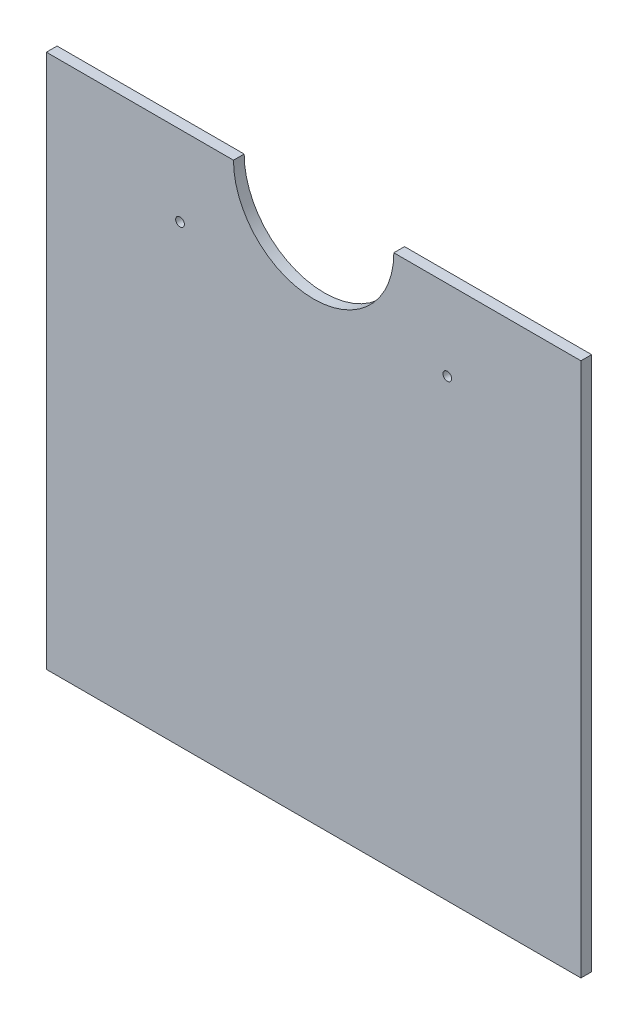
from build123d import *

# Parameters (mm, degrees)
BASE_EXTRUSION_DEPTH    = 8
ESQUISSE2_R             = 3.25
ENL_V_MAT_EXTRU_1_DEPTH = 625.871186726


with BuildPart() as part:
    # Esquisse1 → Base-Extrusion (new body)
    with BuildSketch(Plane.XY):
        with BuildLine():
            Line((260, 480), (400, 480))
            Line((400, 480), (400, 80))
            Line((400, 80), (0, 80))
            Line((0, 80), (0, 480))
            Line((0, 480), (140, 480))
            ThreePointArc((140, 480), (200, 420), (260, 480))
        make_face()
    extrude(amount=BASE_EXTRUSION_DEPTH)

    # Esquisse2 → Enl_v. mat.-Extru.1 (cut, through all)
    with BuildSketch(Plane.XY.offset(8)):
        with Locations((100, 420)):
            Circle(ESQUISSE2_R)
        with Locations((300, 420)):
            Circle(ESQUISSE2_R)
    extrude(amount=-ENL_V_MAT_EXTRU_1_DEPTH, mode=Mode.SUBTRACT)


solid = part.part
